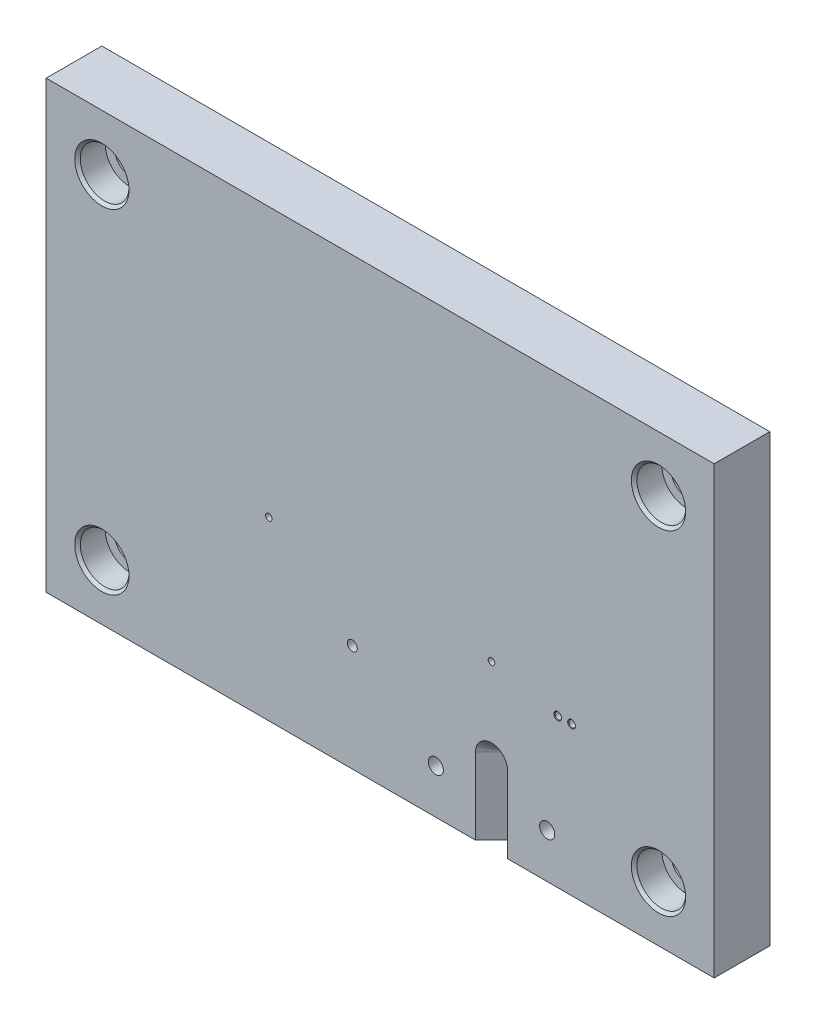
from build123d import *

# Parameters (mm, degrees)
SKETCH1_W                                     = 152.4
SKETCH1_H                                     = 101.6
EXTRUDE1_DEPTH                                = 12.7
CBORE_FOR_1_4_SOCKET_HEAD_CAP_SCREW1_AT_COUNT = 2
CBORE_FOR_1_4_SOCKET_HEAD_CAP_SCREW1_AT_PITCH = 76.2
CBORE_FOR_1_4_SOCKET_HEAD_CAP_SCREW1_2_COUNT  = 2
CBORE_FOR_1_4_SOCKET_HEAD_CAP_SCREW1_2_PITCH  = 148.106178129
CBORE_FOR_1_4_SOCKET_HEAD_CAP_SCREW1_3_COUNT  = 2
CBORE_FOR_1_4_SOCKET_HEAD_CAP_SCREW1_3_PITCH  = 127
F_53_0_0595_DIAMETER_HOLE2_D                  = 1.5113
F_53_0_0595_DIAMETER_HOLE2_DEPTH              = 6.35
F_53_0_0595_DIAMETER_HOLE2_TIP                = 0.454040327
F_53_0_0595_DIAMETER_HOLE1_D                  = 1.5113
EXTRUDE3_DEPTH                                = 17.399
TAP_DRILL_FOR_8_32_TAP1_D                     = 3.4544
CHAMFER1_SIZE                                 = 0.127
TAP_DRILL_FOR_4_40_TAP1_D                     = 2.2606


with BuildPart() as part:
    # Sketch1 → Extrude1 (new body)
    with BuildSketch(Plane.XY):
        with Locations((76.2, 50.8)):
            Rectangle(SKETCH1_W, SKETCH1_H)
    extrude(amount=EXTRUDE1_DEPTH)

    # Sketch9 → CBORE for 1_4 Socket Head Cap Screw1 (revolve, cut)
    with BuildSketch(Plane(origin=(139.7, 12.7, 12.7), x_dir=(0, -1, 0), z_dir=(1, 0, 0))):
        Polygon((0, 0), (0, 12.7), (3.3782, 12.7), (3.3782, 6.35), (5.55625, 6.35), (5.55625, 0.635), (6.19125, 0), align=None)
    cbore_for_1_4_socket_head_cap_screw1 = revolve(axis=Axis((139.7, 12.7, 19.05), (0, 0, -1)), mode=Mode.SUBTRACT)

    # CBORE for 1_4 Socket Head Cap Screw1 at: CBORE for 1_4 Socket Head Cap Screw1 ×2
    with Locations(*[(0, i * CBORE_FOR_1_4_SOCKET_HEAD_CAP_SCREW1_AT_PITCH, 0) for i in range(1, CBORE_FOR_1_4_SOCKET_HEAD_CAP_SCREW1_AT_COUNT)]):
        add(cbore_for_1_4_socket_head_cap_screw1, mode=Mode.SUBTRACT)

    # CBORE for 1_4 Socket Head Cap Screw1 2: CBORE for 1_4 Socket Head Cap Screw1 ×2
    with Locations(*[Vector(-0.8574929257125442, 0.5144957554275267, 0) * (i * CBORE_FOR_1_4_SOCKET_HEAD_CAP_SCREW1_2_PITCH) for i in range(1, CBORE_FOR_1_4_SOCKET_HEAD_CAP_SCREW1_2_COUNT)]):
        add(cbore_for_1_4_socket_head_cap_screw1, mode=Mode.SUBTRACT)

    # CBORE for 1_4 Socket Head Cap Screw1 3: CBORE for 1_4 Socket Head Cap Screw1 ×2
    with Locations(*[(-i * CBORE_FOR_1_4_SOCKET_HEAD_CAP_SCREW1_3_PITCH, 0, 0) for i in range(1, CBORE_FOR_1_4_SOCKET_HEAD_CAP_SCREW1_3_COUNT)]):
        add(cbore_for_1_4_socket_head_cap_screw1, mode=Mode.SUBTRACT)

    # 53 _0.0595_ Diameter Hole2
    with Locations(Plane(origin=(101.6, 37.1348, 12.7), x_dir=(1, 0, 0), z_dir=(0, 0, 1))):
        with Locations((0, 0), (-50.8, 3.1242)):
            Hole(F_53_0_0595_DIAMETER_HOLE2_D / 2, depth=F_53_0_0595_DIAMETER_HOLE2_DEPTH)
            with Locations((0, 0, -(F_53_0_0595_DIAMETER_HOLE2_DEPTH + F_53_0_0595_DIAMETER_HOLE2_TIP / 2))):  # 118° drill point
                Cone(0, F_53_0_0595_DIAMETER_HOLE2_D / 2, F_53_0_0595_DIAMETER_HOLE2_TIP, mode=Mode.SUBTRACT)

    # 53 _0.0595_ Diameter Hole1 (through all)
    with Locations(Plane(origin=(116.69395, 33.909, 12.7), x_dir=(1, 0, 0), z_dir=(0, 0, 1))):
        with Locations((0, 0), (3.175, 0)):
            Hole(F_53_0_0595_DIAMETER_HOLE1_D / 2)

    # Sketch8 → Extrude3 (cut)
    with BuildSketch(Plane.XZ):
        Polygon((97.93732, 12.7), (101.6, 9.03732), (105.26268, 12.7), align=None)
    extrude(amount=-EXTRUDE3_DEPTH, mode=Mode.SUBTRACT)

    # Tap Drill for _8-32 Tap1 (through all)
    with Locations(Plane(origin=(114.3, 10.16, 12.7), x_dir=(1, 0, 0), z_dir=(0, 0, 1))):
        with Locations((0, 0), (-25.4, 0)):
            Hole(TAP_DRILL_FOR_8_32_TAP1_D / 2)

    # Chamfer1
    chamfer1_edges = [part.edges().sort_by_distance(p)[0] for p in [
        (120.6246, 33.909, 12.7),
        (117.4496, 33.909, 12.7),
    ]]
    chamfer(chamfer1_edges, length=CHAMFER1_SIZE)

    # Tap Drill for _4-40 Tap1 (through all)
    with Locations(Plane(origin=(69.85, 24.384, 12.7), x_dir=(1, 0, 0), z_dir=(0, 0, 1))):
        with Locations((0, 0)):
            Hole(TAP_DRILL_FOR_4_40_TAP1_D / 2)

    # Sketch12 → Hole1 (revolve, cut)
    with BuildSketch(Plane(origin=(101.6, 17.399, 12.7), x_dir=(0, -1, 0), z_dir=(1, 0, 0))):
        Polygon((0, 0), (0, 3.6576), (0.00127, 3.6576), (3.6576, 0), align=None)
    revolve(axis=Axis((101.6, 17.399, -97.3), (0, 0, 1)), mode=Mode.SUBTRACT)


solid = part.part
